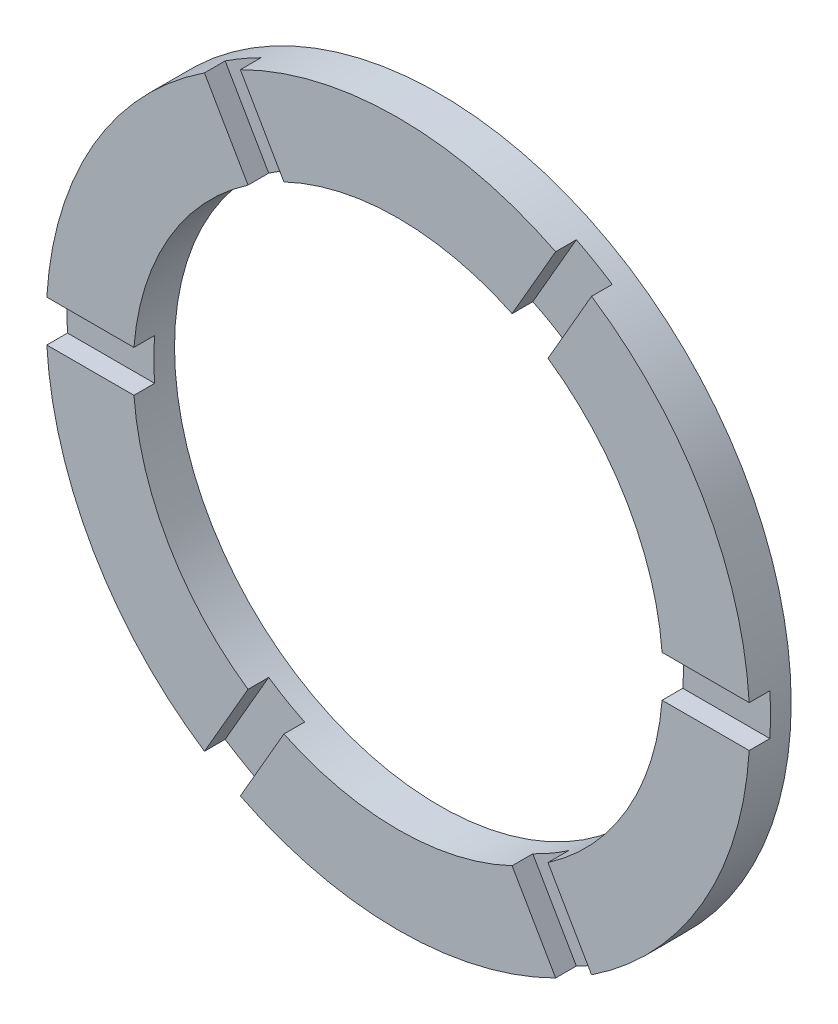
ISO-10303-21;
HEADER;
FILE_DESCRIPTION(('STEP AP214'),'2;1');
FILE_NAME('part.step','',(''),(''),'','','');
FILE_SCHEMA(('AUTOMOTIVE_DESIGN { 1 0 10303 214 1 1 1 1 }'));
ENDSEC;
DATA;
#1=APPLICATION_CONTEXT('core data for automotive mechanical design processes');
#2=APPLICATION_PROTOCOL_DEFINITION('international standard','automotive_design',2000,#1);
#3=PRODUCT_CONTEXT('',#1,'mechanical');
#4=PRODUCT('Part','Part','',(#3));
#5=PRODUCT_RELATED_PRODUCT_CATEGORY('part','',(#4));
#6=PRODUCT_DEFINITION_FORMATION('','',#4);
#7=PRODUCT_DEFINITION_CONTEXT('part definition',#1,'design');
#8=PRODUCT_DEFINITION('design','',#6,#7);
#9=PRODUCT_DEFINITION_SHAPE('','',#8);
#10=(LENGTH_UNIT() NAMED_UNIT(*) SI_UNIT(.MILLI.,.METRE.));
#11=(NAMED_UNIT(*) PLANE_ANGLE_UNIT() SI_UNIT($,.RADIAN.));
#12=(NAMED_UNIT(*) SI_UNIT($,.STERADIAN.) SOLID_ANGLE_UNIT());
#13=UNCERTAINTY_MEASURE_WITH_UNIT(LENGTH_MEASURE(1.E-05),#10,'distance_accuracy_value','');
#14=(GEOMETRIC_REPRESENTATION_CONTEXT(3) GLOBAL_UNCERTAINTY_ASSIGNED_CONTEXT((#13)) GLOBAL_UNIT_ASSIGNED_CONTEXT((#10,
#11,#12)) REPRESENTATION_CONTEXT('',''));
#15=CARTESIAN_POINT('',(0.,0.,0.));
#16=DIRECTION('',(0.,0.,1.));
#17=DIRECTION('',(1.,0.,0.));
#18=AXIS2_PLACEMENT_3D('',#15,#16,#17);
#19=CARTESIAN_POINT('',(0.,0.,0.5));
#20=DIRECTION('',(0.,0.,1.));
#21=DIRECTION('',(1.,0.,0.));
#22=AXIS2_PLACEMENT_3D('',#19,#20,#21);
#23=PLANE('',#22);
#24=DIRECTION('',(0.49999999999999,-0.866025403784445,0.));
#25=VECTOR('',#24,1.);
#26=CARTESIAN_POINT('',(-2.33812918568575,3.5490353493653,0.5));
#27=LINE('',#26,#25);
#28=CARTESIAN_POINT('',(-2.33812918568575,3.5490353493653,0.5));
#29=VERTEX_POINT('',#28);
#30=CARTESIAN_POINT('',(-1.81191503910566,2.63760571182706,0.5));
#31=VERTEX_POINT('',#30);
#32=EDGE_CURVE('E519',#29,#31,#27,.T.);
#33=ORIENTED_EDGE('',*,*,#32,.F.);
#34=CARTESIAN_POINT('',(0.,0.,0.5));
#35=DIRECTION('',(0.,0.,1.));
#36=DIRECTION('',(1.,0.,0.));
#37=AXIS2_PLACEMENT_3D('',#34,#35,#36);
#38=CIRCLE('',#37,4.25);
#39=CARTESIAN_POINT('',(-4.2426193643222,0.250361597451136,0.5));
#40=VERTEX_POINT('',#39);
#41=EDGE_CURVE('E535',#29,#40,#38,.T.);
#42=ORIENTED_EDGE('',*,*,#41,.T.);
#43=DIRECTION('',(-1.,0.,0.));
#44=VECTOR('',#43,1.);
#45=CARTESIAN_POINT('',(-3.07911993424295,0.250361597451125,0.5));
#46=LINE('',#45,#44);
#47=CARTESIAN_POINT('',(-3.190191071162,0.250361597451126,0.5));
#48=VERTEX_POINT('',#47);
#49=EDGE_CURVE('E635',#48,#40,#46,.T.);
#50=ORIENTED_EDGE('',*,*,#49,.F.);
#51=CARTESIAN_POINT('',(0.,0.,0.5));
#52=DIRECTION('',(0.,0.,1.));
#53=DIRECTION('',(1.,0.,0.));
#54=AXIS2_PLACEMENT_3D('',#51,#52,#53);
#55=CIRCLE('',#54,3.2);
#56=EDGE_CURVE('E554',#31,#48,#55,.T.);
#57=ORIENTED_EDGE('',*,*,#56,.F.);
#58=EDGE_LOOP('',(#33,#42,#50,#57));
#59=FACE_BOUND('',#58,.T.);
#60=ADVANCED_FACE('F348',(#59),#23,.T.);
#61=DIRECTION('',(1.,0.,0.));
#62=VECTOR('',#61,1.);
#63=CARTESIAN_POINT('',(-4.2426193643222,-0.250361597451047,0.5));
#64=LINE('',#63,#62);
#65=CARTESIAN_POINT('',(-4.24261936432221,-0.250361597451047,0.5));
#66=VERTEX_POINT('',#65);
#67=CARTESIAN_POINT('',(-3.190191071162,-0.250361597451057,0.5));
#68=VERTEX_POINT('',#67);
#69=EDGE_CURVE('E633',#66,#68,#64,.T.);
#70=ORIENTED_EDGE('',*,*,#69,.F.);
#71=CARTESIAN_POINT('',(-2.33812918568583,-3.54903534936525,0.5));
#72=VERTEX_POINT('',#71);
#73=EDGE_CURVE('E541',#66,#72,#38,.T.);
#74=ORIENTED_EDGE('',*,*,#73,.T.);
#75=DIRECTION('',(-0.500000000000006,-0.866025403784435,0.));
#76=VECTOR('',#75,1.);
#77=CARTESIAN_POINT('',(-1.7563794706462,-2.54141528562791,0.5));
#78=LINE('',#77,#76);
#79=CARTESIAN_POINT('',(-1.81191503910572,-2.63760571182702,0.5));
#80=VERTEX_POINT('',#79);
#81=EDGE_CURVE('E620',#80,#72,#78,.T.);
#82=ORIENTED_EDGE('',*,*,#81,.F.);
#83=EDGE_CURVE('E657',#68,#80,#55,.T.);
#84=ORIENTED_EDGE('',*,*,#83,.F.);
#85=EDGE_LOOP('',(#70,#74,#82,#84));
#86=FACE_BOUND('',#85,.T.);
#87=ADVANCED_FACE('F697',(#86),#23,.T.);
#88=DIRECTION('',(0.500000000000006,0.866025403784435,0.));
#89=VECTOR('',#88,1.);
#90=CARTESIAN_POINT('',(-1.90449017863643,-3.79939694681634,0.5));
#91=LINE('',#90,#89);
#92=CARTESIAN_POINT('',(-1.90449017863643,-3.79939694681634,0.5));
#93=VERTEX_POINT('',#92);
#94=CARTESIAN_POINT('',(-1.37827603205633,-2.88796730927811,0.5));
#95=VERTEX_POINT('',#94);
#96=EDGE_CURVE('E618',#93,#95,#91,.T.);
#97=ORIENTED_EDGE('',*,*,#96,.F.);
#98=CARTESIAN_POINT('',(1.90449017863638,-3.79939694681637,0.5));
#99=VERTEX_POINT('',#98);
#100=EDGE_CURVE('E550',#93,#99,#38,.T.);
#101=ORIENTED_EDGE('',*,*,#100,.T.);
#102=DIRECTION('',(0.499999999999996,-0.866025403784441,0.));
#103=VECTOR('',#102,1.);
#104=CARTESIAN_POINT('',(1.32274046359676,-2.79177688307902,0.5));
#105=LINE('',#104,#103);
#106=CARTESIAN_POINT('',(1.37827603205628,-2.88796730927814,0.5));
#107=VERTEX_POINT('',#106);
#108=EDGE_CURVE('E604',#107,#99,#105,.T.);
#109=ORIENTED_EDGE('',*,*,#108,.F.);
#110=EDGE_CURVE('E658',#95,#107,#55,.T.);
#111=ORIENTED_EDGE('',*,*,#110,.F.);
#112=EDGE_LOOP('',(#97,#101,#109,#111));
#113=FACE_BOUND('',#112,.T.);
#114=ADVANCED_FACE('F693',(#113),#23,.T.);
#115=DIRECTION('',(-0.499999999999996,0.866025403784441,0.));
#116=VECTOR('',#115,1.);
#117=CARTESIAN_POINT('',(2.33812918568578,-3.54903534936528,0.5));
#118=LINE('',#117,#116);
#119=CARTESIAN_POINT('',(2.33812918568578,-3.54903534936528,0.5));
#120=VERTEX_POINT('',#119);
#121=CARTESIAN_POINT('',(1.81191503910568,-2.63760571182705,0.5));
#122=VERTEX_POINT('',#121);
#123=EDGE_CURVE('E602',#120,#122,#118,.T.);
#124=ORIENTED_EDGE('',*,*,#123,.F.);
#125=CARTESIAN_POINT('',(4.2426193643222,-0.250361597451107,0.5));
#126=VERTEX_POINT('',#125);
#127=EDGE_CURVE('E543',#120,#126,#38,.T.);
#128=ORIENTED_EDGE('',*,*,#127,.T.);
#129=DIRECTION('',(1.,0.,0.));
#130=VECTOR('',#129,1.);
#131=CARTESIAN_POINT('',(3.07911993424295,-0.250361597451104,0.5));
#132=LINE('',#131,#130);
#133=CARTESIAN_POINT('',(3.190191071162,-0.250361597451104,0.5));
#134=VERTEX_POINT('',#133);
#135=EDGE_CURVE('E588',#134,#126,#132,.T.);
#136=ORIENTED_EDGE('',*,*,#135,.F.);
#137=EDGE_CURVE('E663',#122,#134,#55,.T.);
#138=ORIENTED_EDGE('',*,*,#137,.F.);
#139=EDGE_LOOP('',(#124,#128,#136,#138));
#140=FACE_BOUND('',#139,.T.);
#141=ADVANCED_FACE('F687',(#140),#23,.T.);
#142=DIRECTION('',(-1.,0.,0.));
#143=VECTOR('',#142,1.);
#144=CARTESIAN_POINT('',(4.2426193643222,0.250361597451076,0.5));
#145=LINE('',#144,#143);
#146=CARTESIAN_POINT('',(4.2426193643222,0.250361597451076,0.5));
#147=VERTEX_POINT('',#146);
#148=CARTESIAN_POINT('',(3.190191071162,0.250361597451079,0.5));
#149=VERTEX_POINT('',#148);
#150=EDGE_CURVE('E586',#147,#149,#145,.T.);
#151=ORIENTED_EDGE('',*,*,#150,.F.);
#152=CARTESIAN_POINT('',(2.3381291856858,3.54903534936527,0.5));
#153=VERTEX_POINT('',#152);
#154=EDGE_CURVE('E537',#147,#153,#38,.T.);
#155=ORIENTED_EDGE('',*,*,#154,.T.);
#156=DIRECTION('',(0.5,0.866025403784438,0.));
#157=VECTOR('',#156,1.);
#158=CARTESIAN_POINT('',(1.75637947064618,2.54141528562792,0.5));
#159=LINE('',#158,#157);
#160=CARTESIAN_POINT('',(1.8119150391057,2.63760571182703,0.5));
#161=VERTEX_POINT('',#160);
#162=EDGE_CURVE('E573',#161,#153,#159,.T.);
#163=ORIENTED_EDGE('',*,*,#162,.F.);
#164=EDGE_CURVE('E556',#149,#161,#55,.T.);
#165=ORIENTED_EDGE('',*,*,#164,.F.);
#166=EDGE_LOOP('',(#151,#155,#163,#165));
#167=FACE_BOUND('',#166,.T.);
#168=ADVANCED_FACE('F685',(#167),#23,.T.);
#169=DIRECTION('',(-0.49999999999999,0.866025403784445,0.));
#170=VECTOR('',#169,1.);
#171=CARTESIAN_POINT('',(-1.32274046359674,2.79177688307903,0.5));
#172=LINE('',#171,#170);
#173=CARTESIAN_POINT('',(-1.37827603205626,2.88796730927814,0.5));
#174=VERTEX_POINT('',#173);
#175=CARTESIAN_POINT('',(-1.90449017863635,3.79939694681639,0.5));
#176=VERTEX_POINT('',#175);
#177=EDGE_CURVE('E508',#174,#176,#172,.T.);
#178=ORIENTED_EDGE('',*,*,#177,.F.);
#179=CARTESIAN_POINT('',(1.37827603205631,2.88796730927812,0.5));
#180=VERTEX_POINT('',#179);
#181=EDGE_CURVE('E552',#180,#174,#55,.T.);
#182=ORIENTED_EDGE('',*,*,#181,.F.);
#183=DIRECTION('',(-0.5,-0.866025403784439,0.));
#184=VECTOR('',#183,1.);
#185=CARTESIAN_POINT('',(1.90449017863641,3.79939694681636,0.5));
#186=LINE('',#185,#184);
#187=CARTESIAN_POINT('',(1.90449017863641,3.79939694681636,0.5));
#188=VERTEX_POINT('',#187);
#189=EDGE_CURVE('E533',#188,#180,#186,.T.);
#190=ORIENTED_EDGE('',*,*,#189,.F.);
#191=EDGE_CURVE('E526',#188,#176,#38,.T.);
#192=ORIENTED_EDGE('',*,*,#191,.T.);
#193=EDGE_LOOP('',(#178,#182,#190,#192));
#194=FACE_BOUND('',#193,.T.);
#195=ADVANCED_FACE('F532',(#194),#23,.T.);
#196=CARTESIAN_POINT('',(0.,0.,0.));
#197=DIRECTION('',(0.,0.,1.));
#198=DIRECTION('',(1.,0.,0.));
#199=AXIS2_PLACEMENT_3D('',#196,#197,#198);
#200=PLANE('',#199);
#201=CARTESIAN_POINT('',(0.,0.,0.));
#202=DIRECTION('',(0.,0.,1.));
#203=DIRECTION('',(1.,0.,0.));
#204=AXIS2_PLACEMENT_3D('',#201,#202,#203);
#205=CIRCLE('',#204,4.25);
#206=CARTESIAN_POINT('',(4.25,0.,0.));
#207=VERTEX_POINT('',#206);
#208=EDGE_CURVE('E544',#207,#207,#205,.T.);
#209=ORIENTED_EDGE('',*,*,#208,.F.);
#210=EDGE_LOOP('',(#209));
#211=FACE_BOUND('',#210,.T.);
#212=CARTESIAN_POINT('',(0.,0.,0.));
#213=DIRECTION('',(0.,0.,1.));
#214=DIRECTION('',(1.,0.,0.));
#215=AXIS2_PLACEMENT_3D('',#212,#213,#214);
#216=CIRCLE('',#215,3.2);
#217=CARTESIAN_POINT('',(3.2,0.,0.));
#218=VERTEX_POINT('',#217);
#219=EDGE_CURVE('E558',#218,#218,#216,.T.);
#220=ORIENTED_EDGE('',*,*,#219,.T.);
#221=EDGE_LOOP('',(#220));
#222=FACE_BOUND('',#221,.T.);
#223=ADVANCED_FACE('F692',(#211,#222),#200,.F.);
#224=CARTESIAN_POINT('',(0.,0.,0.5));
#225=DIRECTION('',(0.,0.,-1.));
#226=DIRECTION('',(-1.,0.,0.));
#227=AXIS2_PLACEMENT_3D('',#224,#225,#226);
#228=CYLINDRICAL_SURFACE('',#227,4.25);
#229=ORIENTED_EDGE('',*,*,#41,.F.);
#230=DIRECTION('',(0.,0.,1.));
#231=VECTOR('',#230,1.);
#232=CARTESIAN_POINT('',(-2.33812918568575,3.5490353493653,0.25));
#233=LINE('',#232,#231);
#234=CARTESIAN_POINT('',(-2.33812918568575,3.5490353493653,0.25));
#235=VERTEX_POINT('',#234);
#236=EDGE_CURVE('E529',#235,#29,#233,.T.);
#237=ORIENTED_EDGE('',*,*,#236,.F.);
#238=CARTESIAN_POINT('',(0.,0.,0.25));
#239=DIRECTION('',(0.,0.,1.));
#240=DIRECTION('',(0.50000000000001,0.866025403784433,0.));
#241=AXIS2_PLACEMENT_3D('',#238,#239,#240);
#242=CIRCLE('',#241,4.25);
#243=CARTESIAN_POINT('',(-1.90449017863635,3.79939694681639,0.25));
#244=VERTEX_POINT('',#243);
#245=EDGE_CURVE('E528',#244,#235,#242,.T.);
#246=ORIENTED_EDGE('',*,*,#245,.F.);
#247=DIRECTION('',(0.,0.,1.));
#248=VECTOR('',#247,1.);
#249=CARTESIAN_POINT('',(-1.90449017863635,3.79939694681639,0.25));
#250=LINE('',#249,#248);
#251=EDGE_CURVE('E512',#244,#176,#250,.T.);
#252=ORIENTED_EDGE('',*,*,#251,.T.);
#253=ORIENTED_EDGE('',*,*,#191,.F.);
#254=DIRECTION('',(0.,0.,1.));
#255=VECTOR('',#254,1.);
#256=CARTESIAN_POINT('',(1.90449017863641,3.79939694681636,0.25));
#257=LINE('',#256,#255);
#258=CARTESIAN_POINT('',(1.90449017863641,3.79939694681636,0.25));
#259=VERTEX_POINT('',#258);
#260=EDGE_CURVE('E561',#259,#188,#257,.T.);
#261=ORIENTED_EDGE('',*,*,#260,.F.);
#262=CARTESIAN_POINT('',(0.,0.,0.25));
#263=DIRECTION('',(0.,0.,1.));
#264=DIRECTION('',(1.,0.,0.));
#265=AXIS2_PLACEMENT_3D('',#262,#263,#264);
#266=CIRCLE('',#265,4.25);
#267=CARTESIAN_POINT('',(2.3381291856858,3.54903534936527,0.25));
#268=VERTEX_POINT('',#267);
#269=EDGE_CURVE('E568',#268,#259,#266,.T.);
#270=ORIENTED_EDGE('',*,*,#269,.F.);
#271=DIRECTION('',(0.,0.,1.));
#272=VECTOR('',#271,1.);
#273=CARTESIAN_POINT('',(2.3381291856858,3.54903534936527,0.25));
#274=LINE('',#273,#272);
#275=EDGE_CURVE('E562',#268,#153,#274,.T.);
#276=ORIENTED_EDGE('',*,*,#275,.T.);
#277=ORIENTED_EDGE('',*,*,#154,.F.);
#278=DIRECTION('',(0.,0.,1.));
#279=VECTOR('',#278,1.);
#280=CARTESIAN_POINT('',(4.2426193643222,0.250361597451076,0.25));
#281=LINE('',#280,#279);
#282=CARTESIAN_POINT('',(4.2426193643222,0.250361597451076,0.25));
#283=VERTEX_POINT('',#282);
#284=EDGE_CURVE('E575',#283,#147,#281,.T.);
#285=ORIENTED_EDGE('',*,*,#284,.F.);
#286=CARTESIAN_POINT('',(0.,0.,0.25));
#287=DIRECTION('',(0.,0.,1.));
#288=DIRECTION('',(0.499999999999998,-0.86602540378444,0.));
#289=AXIS2_PLACEMENT_3D('',#286,#287,#288);
#290=CIRCLE('',#289,4.25);
#291=CARTESIAN_POINT('',(4.2426193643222,-0.250361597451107,0.25));
#292=VERTEX_POINT('',#291);
#293=EDGE_CURVE('E582',#292,#283,#290,.T.);
#294=ORIENTED_EDGE('',*,*,#293,.F.);
#295=DIRECTION('',(0.,0.,1.));
#296=VECTOR('',#295,1.);
#297=CARTESIAN_POINT('',(4.2426193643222,-0.250361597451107,0.25));
#298=LINE('',#297,#296);
#299=EDGE_CURVE('E576',#292,#126,#298,.T.);
#300=ORIENTED_EDGE('',*,*,#299,.T.);
#301=ORIENTED_EDGE('',*,*,#127,.F.);
#302=DIRECTION('',(0.,0.,1.));
#303=VECTOR('',#302,1.);
#304=CARTESIAN_POINT('',(2.33812918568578,-3.54903534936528,0.25));
#305=LINE('',#304,#303);
#306=CARTESIAN_POINT('',(2.33812918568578,-3.54903534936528,0.25));
#307=VERTEX_POINT('',#306);
#308=EDGE_CURVE('E591',#307,#120,#305,.T.);
#309=ORIENTED_EDGE('',*,*,#308,.F.);
#310=CARTESIAN_POINT('',(0.,0.,0.25));
#311=DIRECTION('',(0.,0.,1.));
#312=DIRECTION('',(-0.500000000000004,-0.866025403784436,0.));
#313=AXIS2_PLACEMENT_3D('',#310,#311,#312);
#314=CIRCLE('',#313,4.25);
#315=CARTESIAN_POINT('',(1.90449017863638,-3.79939694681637,0.25));
#316=VERTEX_POINT('',#315);
#317=EDGE_CURVE('E598',#316,#307,#314,.T.);
#318=ORIENTED_EDGE('',*,*,#317,.F.);
#319=DIRECTION('',(0.,0.,1.));
#320=VECTOR('',#319,1.);
#321=CARTESIAN_POINT('',(1.90449017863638,-3.79939694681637,0.25));
#322=LINE('',#321,#320);
#323=EDGE_CURVE('E592',#316,#99,#322,.T.);
#324=ORIENTED_EDGE('',*,*,#323,.T.);
#325=ORIENTED_EDGE('',*,*,#100,.F.);
#326=DIRECTION('',(0.,0.,1.));
#327=VECTOR('',#326,1.);
#328=CARTESIAN_POINT('',(-1.90449017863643,-3.79939694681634,0.25));
#329=LINE('',#328,#327);
#330=CARTESIAN_POINT('',(-1.90449017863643,-3.79939694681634,0.25));
#331=VERTEX_POINT('',#330);
#332=EDGE_CURVE('E607',#331,#93,#329,.T.);
#333=ORIENTED_EDGE('',*,*,#332,.F.);
#334=CARTESIAN_POINT('',(0.,0.,0.25));
#335=DIRECTION('',(0.,0.,1.));
#336=DIRECTION('',(-1.,0.,0.));
#337=AXIS2_PLACEMENT_3D('',#334,#335,#336);
#338=CIRCLE('',#337,4.25);
#339=CARTESIAN_POINT('',(-2.33812918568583,-3.54903534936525,0.25));
#340=VERTEX_POINT('',#339);
#341=EDGE_CURVE('E614',#340,#331,#338,.T.);
#342=ORIENTED_EDGE('',*,*,#341,.F.);
#343=DIRECTION('',(0.,0.,1.));
#344=VECTOR('',#343,1.);
#345=CARTESIAN_POINT('',(-2.33812918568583,-3.54903534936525,0.25));
#346=LINE('',#345,#344);
#347=EDGE_CURVE('E608',#340,#72,#346,.T.);
#348=ORIENTED_EDGE('',*,*,#347,.T.);
#349=ORIENTED_EDGE('',*,*,#73,.F.);
#350=DIRECTION('',(0.,0.,1.));
#351=VECTOR('',#350,1.);
#352=CARTESIAN_POINT('',(-4.24261936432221,-0.250361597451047,0.25));
#353=LINE('',#352,#351);
#354=CARTESIAN_POINT('',(-4.24261936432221,-0.250361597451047,0.25));
#355=VERTEX_POINT('',#354);
#356=EDGE_CURVE('E623',#355,#66,#353,.T.);
#357=ORIENTED_EDGE('',*,*,#356,.F.);
#358=CARTESIAN_POINT('',(0.,0.,0.25));
#359=DIRECTION('',(0.,0.,1.));
#360=DIRECTION('',(-0.499999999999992,0.866025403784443,0.));
#361=AXIS2_PLACEMENT_3D('',#358,#359,#360);
#362=CIRCLE('',#361,4.25);
#363=CARTESIAN_POINT('',(-4.2426193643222,0.250361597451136,0.25));
#364=VERTEX_POINT('',#363);
#365=EDGE_CURVE('E629',#364,#355,#362,.T.);
#366=ORIENTED_EDGE('',*,*,#365,.F.);
#367=DIRECTION('',(0.,0.,1.));
#368=VECTOR('',#367,1.);
#369=CARTESIAN_POINT('',(-4.2426193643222,0.250361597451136,0.25));
#370=LINE('',#369,#368);
#371=EDGE_CURVE('E624',#364,#40,#370,.T.);
#372=ORIENTED_EDGE('',*,*,#371,.T.);
#373=EDGE_LOOP('',(#229,#237,#246,#252,#253,#261,#270,#276,#277,#285,#294,#300,#301,#309,#318,
#324,#325,#333,#342,#348,#349,#357,#366,#372));
#374=FACE_BOUND('',#373,.T.);
#375=ORIENTED_EDGE('',*,*,#208,.T.);
#376=EDGE_LOOP('',(#375));
#377=FACE_BOUND('',#376,.T.);
#378=ADVANCED_FACE('F350',(#374,#377),#228,.T.);
#379=CARTESIAN_POINT('',(0.,0.,0.5));
#380=DIRECTION('',(0.,0.,-1.));
#381=DIRECTION('',(-1.,0.,0.));
#382=AXIS2_PLACEMENT_3D('',#379,#380,#381);
#383=CYLINDRICAL_SURFACE('',#382,3.2);
#384=DIRECTION('',(0.,0.,-1.));
#385=VECTOR('',#384,1.);
#386=CARTESIAN_POINT('',(-1.81191503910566,2.63760571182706,0.5));
#387=LINE('',#386,#385);
#388=CARTESIAN_POINT('',(-1.81191503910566,2.63760571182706,0.25));
#389=VERTEX_POINT('',#388);
#390=EDGE_CURVE('E11',#31,#389,#387,.T.);
#391=ORIENTED_EDGE('',*,*,#390,.F.);
#392=ORIENTED_EDGE('',*,*,#56,.T.);
#393=DIRECTION('',(0.,0.,-1.));
#394=VECTOR('',#393,1.);
#395=CARTESIAN_POINT('',(-3.190191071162,0.250361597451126,0.5));
#396=LINE('',#395,#394);
#397=CARTESIAN_POINT('',(-3.190191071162,0.250361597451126,0.25));
#398=VERTEX_POINT('',#397);
#399=EDGE_CURVE('E755',#398,#48,#396,.F.);
#400=ORIENTED_EDGE('',*,*,#399,.F.);
#401=CARTESIAN_POINT('',(0.,0.,0.25));
#402=DIRECTION('',(0.,0.,1.));
#403=DIRECTION('',(1.,0.,0.));
#404=AXIS2_PLACEMENT_3D('',#401,#402,#403);
#405=CIRCLE('',#404,3.2);
#406=CARTESIAN_POINT('',(-3.190191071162,-0.250361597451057,0.25));
#407=VERTEX_POINT('',#406);
#408=EDGE_CURVE('E752',#398,#407,#405,.T.);
#409=ORIENTED_EDGE('',*,*,#408,.T.);
#410=DIRECTION('',(0.,0.,-1.));
#411=VECTOR('',#410,1.);
#412=CARTESIAN_POINT('',(-3.190191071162,-0.250361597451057,0.5));
#413=LINE('',#412,#411);
#414=EDGE_CURVE('E757',#68,#407,#413,.T.);
#415=ORIENTED_EDGE('',*,*,#414,.F.);
#416=ORIENTED_EDGE('',*,*,#83,.T.);
#417=DIRECTION('',(0.,0.,-1.));
#418=VECTOR('',#417,1.);
#419=CARTESIAN_POINT('',(-1.81191503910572,-2.63760571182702,0.5));
#420=LINE('',#419,#418);
#421=CARTESIAN_POINT('',(-1.81191503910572,-2.63760571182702,0.25));
#422=VERTEX_POINT('',#421);
#423=EDGE_CURVE('E747',#422,#80,#420,.F.);
#424=ORIENTED_EDGE('',*,*,#423,.F.);
#425=CARTESIAN_POINT('',(0.,0.,0.25));
#426=DIRECTION('',(0.,0.,1.));
#427=DIRECTION('',(1.,0.,0.));
#428=AXIS2_PLACEMENT_3D('',#425,#426,#427);
#429=CIRCLE('',#428,3.2);
#430=CARTESIAN_POINT('',(-1.37827603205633,-2.88796730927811,0.25));
#431=VERTEX_POINT('',#430);
#432=EDGE_CURVE('E736',#422,#431,#429,.T.);
#433=ORIENTED_EDGE('',*,*,#432,.T.);
#434=DIRECTION('',(0.,0.,-1.));
#435=VECTOR('',#434,1.);
#436=CARTESIAN_POINT('',(-1.37827603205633,-2.88796730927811,0.5));
#437=LINE('',#436,#435);
#438=EDGE_CURVE('E749',#95,#431,#437,.T.);
#439=ORIENTED_EDGE('',*,*,#438,.F.);
#440=ORIENTED_EDGE('',*,*,#110,.T.);
#441=DIRECTION('',(0.,0.,-1.));
#442=VECTOR('',#441,1.);
#443=CARTESIAN_POINT('',(1.37827603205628,-2.88796730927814,0.5));
#444=LINE('',#443,#442);
#445=CARTESIAN_POINT('',(1.37827603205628,-2.88796730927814,0.25));
#446=VERTEX_POINT('',#445);
#447=EDGE_CURVE('E724',#446,#107,#444,.F.);
#448=ORIENTED_EDGE('',*,*,#447,.F.);
#449=CARTESIAN_POINT('',(0.,0.,0.25));
#450=DIRECTION('',(0.,0.,1.));
#451=DIRECTION('',(1.,0.,0.));
#452=AXIS2_PLACEMENT_3D('',#449,#450,#451);
#453=CIRCLE('',#452,3.2);
#454=CARTESIAN_POINT('',(1.81191503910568,-2.63760571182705,0.25));
#455=VERTEX_POINT('',#454);
#456=EDGE_CURVE('E738',#446,#455,#453,.T.);
#457=ORIENTED_EDGE('',*,*,#456,.T.);
#458=DIRECTION('',(0.,0.,-1.));
#459=VECTOR('',#458,1.);
#460=CARTESIAN_POINT('',(1.81191503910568,-2.63760571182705,0.5));
#461=LINE('',#460,#459);
#462=EDGE_CURVE('E734',#122,#455,#461,.T.);
#463=ORIENTED_EDGE('',*,*,#462,.F.);
#464=ORIENTED_EDGE('',*,*,#137,.T.);
#465=DIRECTION('',(0.,0.,-1.));
#466=VECTOR('',#465,1.);
#467=CARTESIAN_POINT('',(3.190191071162,-0.250361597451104,0.5));
#468=LINE('',#467,#466);
#469=CARTESIAN_POINT('',(3.190191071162,-0.250361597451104,0.25));
#470=VERTEX_POINT('',#469);
#471=EDGE_CURVE('E741',#470,#134,#468,.F.);
#472=ORIENTED_EDGE('',*,*,#471,.F.);
#473=CARTESIAN_POINT('',(0.,0.,0.25));
#474=DIRECTION('',(0.,0.,1.));
#475=DIRECTION('',(1.,0.,0.));
#476=AXIS2_PLACEMENT_3D('',#473,#474,#475);
#477=CIRCLE('',#476,3.2);
#478=CARTESIAN_POINT('',(3.190191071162,0.250361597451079,0.25));
#479=VERTEX_POINT('',#478);
#480=EDGE_CURVE('E900',#470,#479,#477,.T.);
#481=ORIENTED_EDGE('',*,*,#480,.T.);
#482=DIRECTION('',(0.,0.,-1.));
#483=VECTOR('',#482,1.);
#484=CARTESIAN_POINT('',(3.190191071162,0.250361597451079,0.5));
#485=LINE('',#484,#483);
#486=EDGE_CURVE('E678',#149,#479,#485,.T.);
#487=ORIENTED_EDGE('',*,*,#486,.F.);
#488=ORIENTED_EDGE('',*,*,#164,.T.);
#489=DIRECTION('',(0.,0.,-1.));
#490=VECTOR('',#489,1.);
#491=CARTESIAN_POINT('',(1.8119150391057,2.63760571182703,0.5));
#492=LINE('',#491,#490);
#493=CARTESIAN_POINT('',(1.8119150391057,2.63760571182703,0.25));
#494=VERTEX_POINT('',#493);
#495=EDGE_CURVE('E539',#494,#161,#492,.F.);
#496=ORIENTED_EDGE('',*,*,#495,.F.);
#497=CARTESIAN_POINT('',(0.,0.,0.25));
#498=DIRECTION('',(0.,0.,1.));
#499=DIRECTION('',(1.,0.,0.));
#500=AXIS2_PLACEMENT_3D('',#497,#498,#499);
#501=CIRCLE('',#500,3.2);
#502=CARTESIAN_POINT('',(1.37827603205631,2.88796730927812,0.25));
#503=VERTEX_POINT('',#502);
#504=EDGE_CURVE('E534',#494,#503,#501,.T.);
#505=ORIENTED_EDGE('',*,*,#504,.T.);
#506=DIRECTION('',(0.,0.,-1.));
#507=VECTOR('',#506,1.);
#508=CARTESIAN_POINT('',(1.37827603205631,2.88796730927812,0.5));
#509=LINE('',#508,#507);
#510=EDGE_CURVE('E683',#180,#503,#509,.T.);
#511=ORIENTED_EDGE('',*,*,#510,.F.);
#512=ORIENTED_EDGE('',*,*,#181,.T.);
#513=DIRECTION('',(0.,0.,-1.));
#514=VECTOR('',#513,1.);
#515=CARTESIAN_POINT('',(-1.37827603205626,2.88796730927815,0.5));
#516=LINE('',#515,#514);
#517=CARTESIAN_POINT('',(-1.37827603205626,2.88796730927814,0.25));
#518=VERTEX_POINT('',#517);
#519=EDGE_CURVE('E356',#518,#174,#516,.F.);
#520=ORIENTED_EDGE('',*,*,#519,.F.);
#521=CARTESIAN_POINT('',(0.,0.,0.25));
#522=DIRECTION('',(0.,0.,1.));
#523=DIRECTION('',(1.,0.,0.));
#524=AXIS2_PLACEMENT_3D('',#521,#522,#523);
#525=CIRCLE('',#524,3.2);
#526=EDGE_CURVE('E655',#518,#389,#525,.T.);
#527=ORIENTED_EDGE('',*,*,#526,.T.);
#528=EDGE_LOOP('',(#391,#392,#400,#409,#415,#416,#424,#433,#439,#440,#448,#457,#463,#464,#472,
#481,#487,#488,#496,#505,#511,#512,#520,#527));
#529=FACE_BOUND('',#528,.T.);
#530=ORIENTED_EDGE('',*,*,#219,.F.);
#531=EDGE_LOOP('',(#530));
#532=FACE_BOUND('',#531,.T.);
#533=ADVANCED_FACE('F651',(#529,#532),#383,.F.);
#534=CARTESIAN_POINT('',(1.90449017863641,3.79939694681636,0.25));
#535=DIRECTION('',(-0.866025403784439,0.5,0.));
#536=DIRECTION('',(-0.5,-0.866025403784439,0.));
#537=AXIS2_PLACEMENT_3D('',#534,#535,#536);
#538=PLANE('',#537);
#539=ORIENTED_EDGE('',*,*,#510,.T.);
#540=DIRECTION('',(-0.5,-0.866025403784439,0.));
#541=VECTOR('',#540,1.);
#542=CARTESIAN_POINT('',(1.90449017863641,3.79939694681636,0.25));
#543=LINE('',#542,#541);
#544=EDGE_CURVE('E565',#259,#503,#543,.T.);
#545=ORIENTED_EDGE('',*,*,#544,.F.);
#546=ORIENTED_EDGE('',*,*,#260,.T.);
#547=ORIENTED_EDGE('',*,*,#189,.T.);
#548=EDGE_LOOP('',(#539,#545,#546,#547));
#549=FACE_BOUND('',#548,.T.);
#550=ADVANCED_FACE('F807',(#549),#538,.F.);
#551=CARTESIAN_POINT('',(1.75637947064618,2.54141528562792,0.25));
#552=DIRECTION('',(0.866025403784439,-0.5,0.));
#553=DIRECTION('',(0.5,0.866025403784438,0.));
#554=AXIS2_PLACEMENT_3D('',#551,#552,#553);
#555=PLANE('',#554);
#556=ORIENTED_EDGE('',*,*,#495,.T.);
#557=ORIENTED_EDGE('',*,*,#162,.T.);
#558=ORIENTED_EDGE('',*,*,#275,.F.);
#559=DIRECTION('',(0.5,0.866025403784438,0.));
#560=VECTOR('',#559,1.);
#561=CARTESIAN_POINT('',(1.75637947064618,2.54141528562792,0.25));
#562=LINE('',#561,#560);
#563=EDGE_CURVE('E570',#494,#268,#562,.T.);
#564=ORIENTED_EDGE('',*,*,#563,.F.);
#565=EDGE_LOOP('',(#556,#557,#558,#564));
#566=FACE_BOUND('',#565,.T.);
#567=ADVANCED_FACE('F681',(#566),#555,.F.);
#568=CARTESIAN_POINT('',(0.,0.,0.25));
#569=DIRECTION('',(0.,0.,1.));
#570=DIRECTION('',(1.,0.,0.));
#571=AXIS2_PLACEMENT_3D('',#568,#569,#570);
#572=PLANE('',#571);
#573=ORIENTED_EDGE('',*,*,#563,.T.);
#574=ORIENTED_EDGE('',*,*,#269,.T.);
#575=ORIENTED_EDGE('',*,*,#544,.T.);
#576=ORIENTED_EDGE('',*,*,#504,.F.);
#577=EDGE_LOOP('',(#573,#574,#575,#576));
#578=FACE_BOUND('',#577,.T.);
#579=ADVANCED_FACE('F800',(#578),#572,.T.);
#580=CARTESIAN_POINT('',(4.2426193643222,0.250361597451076,0.25));
#581=DIRECTION('',(0.,1.,0.));
#582=DIRECTION('',(-1.,0.,0.));
#583=AXIS2_PLACEMENT_3D('',#580,#581,#582);
#584=PLANE('',#583);
#585=ORIENTED_EDGE('',*,*,#486,.T.);
#586=DIRECTION('',(-1.,0.,0.));
#587=VECTOR('',#586,1.);
#588=CARTESIAN_POINT('',(4.2426193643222,0.250361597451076,0.25));
#589=LINE('',#588,#587);
#590=EDGE_CURVE('E579',#283,#479,#589,.T.);
#591=ORIENTED_EDGE('',*,*,#590,.F.);
#592=ORIENTED_EDGE('',*,*,#284,.T.);
#593=ORIENTED_EDGE('',*,*,#150,.T.);
#594=EDGE_LOOP('',(#585,#591,#592,#593));
#595=FACE_BOUND('',#594,.T.);
#596=ADVANCED_FACE('F797',(#595),#584,.F.);
#597=CARTESIAN_POINT('',(3.07911993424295,-0.250361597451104,0.25));
#598=DIRECTION('',(0.,-1.,0.));
#599=DIRECTION('',(1.,0.,0.));
#600=AXIS2_PLACEMENT_3D('',#597,#598,#599);
#601=PLANE('',#600);
#602=ORIENTED_EDGE('',*,*,#471,.T.);
#603=ORIENTED_EDGE('',*,*,#135,.T.);
#604=ORIENTED_EDGE('',*,*,#299,.F.);
#605=DIRECTION('',(1.,0.,0.));
#606=VECTOR('',#605,1.);
#607=CARTESIAN_POINT('',(3.07911993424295,-0.250361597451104,0.25));
#608=LINE('',#607,#606);
#609=EDGE_CURVE('E584',#470,#292,#608,.T.);
#610=ORIENTED_EDGE('',*,*,#609,.F.);
#611=EDGE_LOOP('',(#602,#603,#604,#610));
#612=FACE_BOUND('',#611,.T.);
#613=ADVANCED_FACE('F795',(#612),#601,.F.);
#614=CARTESIAN_POINT('',(0.,0.,0.25));
#615=DIRECTION('',(0.,0.,1.));
#616=DIRECTION('',(0.499999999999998,-0.86602540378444,0.));
#617=AXIS2_PLACEMENT_3D('',#614,#615,#616);
#618=PLANE('',#617);
#619=ORIENTED_EDGE('',*,*,#609,.T.);
#620=ORIENTED_EDGE('',*,*,#293,.T.);
#621=ORIENTED_EDGE('',*,*,#590,.T.);
#622=ORIENTED_EDGE('',*,*,#480,.F.);
#623=EDGE_LOOP('',(#619,#620,#621,#622));
#624=FACE_BOUND('',#623,.T.);
#625=ADVANCED_FACE('F790',(#624),#618,.T.);
#626=CARTESIAN_POINT('',(2.33812918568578,-3.54903534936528,0.25));
#627=DIRECTION('',(0.866025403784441,0.499999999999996,0.));
#628=DIRECTION('',(-0.499999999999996,0.866025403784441,0.));
#629=AXIS2_PLACEMENT_3D('',#626,#627,#628);
#630=PLANE('',#629);
#631=ORIENTED_EDGE('',*,*,#462,.T.);
#632=DIRECTION('',(-0.499999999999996,0.866025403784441,0.));
#633=VECTOR('',#632,1.);
#634=CARTESIAN_POINT('',(2.33812918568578,-3.54903534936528,0.25));
#635=LINE('',#634,#633);
#636=EDGE_CURVE('E595',#307,#455,#635,.T.);
#637=ORIENTED_EDGE('',*,*,#636,.F.);
#638=ORIENTED_EDGE('',*,*,#308,.T.);
#639=ORIENTED_EDGE('',*,*,#123,.T.);
#640=EDGE_LOOP('',(#631,#637,#638,#639));
#641=FACE_BOUND('',#640,.T.);
#642=ADVANCED_FACE('F732',(#641),#630,.F.);
#643=CARTESIAN_POINT('',(1.32274046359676,-2.79177688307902,0.25));
#644=DIRECTION('',(-0.866025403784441,-0.499999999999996,0.));
#645=DIRECTION('',(0.499999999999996,-0.866025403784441,0.));
#646=AXIS2_PLACEMENT_3D('',#643,#644,#645);
#647=PLANE('',#646);
#648=ORIENTED_EDGE('',*,*,#447,.T.);
#649=ORIENTED_EDGE('',*,*,#108,.T.);
#650=ORIENTED_EDGE('',*,*,#323,.F.);
#651=DIRECTION('',(0.499999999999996,-0.866025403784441,0.));
#652=VECTOR('',#651,1.);
#653=CARTESIAN_POINT('',(1.32274046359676,-2.79177688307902,0.25));
#654=LINE('',#653,#652);
#655=EDGE_CURVE('E600',#446,#316,#654,.T.);
#656=ORIENTED_EDGE('',*,*,#655,.F.);
#657=EDGE_LOOP('',(#648,#649,#650,#656));
#658=FACE_BOUND('',#657,.T.);
#659=ADVANCED_FACE('F721',(#658),#647,.F.);
#660=CARTESIAN_POINT('',(0.,0.,0.25));
#661=DIRECTION('',(0.,0.,1.));
#662=DIRECTION('',(-0.500000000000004,-0.866025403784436,0.));
#663=AXIS2_PLACEMENT_3D('',#660,#661,#662);
#664=PLANE('',#663);
#665=ORIENTED_EDGE('',*,*,#655,.T.);
#666=ORIENTED_EDGE('',*,*,#317,.T.);
#667=ORIENTED_EDGE('',*,*,#636,.T.);
#668=ORIENTED_EDGE('',*,*,#456,.F.);
#669=EDGE_LOOP('',(#665,#666,#667,#668));
#670=FACE_BOUND('',#669,.T.);
#671=ADVANCED_FACE('F729',(#670),#664,.T.);
#672=CARTESIAN_POINT('',(-1.90449017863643,-3.79939694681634,0.25));
#673=DIRECTION('',(0.866025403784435,-0.500000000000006,0.));
#674=DIRECTION('',(0.500000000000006,0.866025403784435,0.));
#675=AXIS2_PLACEMENT_3D('',#672,#673,#674);
#676=PLANE('',#675);
#677=ORIENTED_EDGE('',*,*,#438,.T.);
#678=DIRECTION('',(0.500000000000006,0.866025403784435,0.));
#679=VECTOR('',#678,1.);
#680=CARTESIAN_POINT('',(-1.90449017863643,-3.79939694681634,0.25));
#681=LINE('',#680,#679);
#682=EDGE_CURVE('E611',#331,#431,#681,.T.);
#683=ORIENTED_EDGE('',*,*,#682,.F.);
#684=ORIENTED_EDGE('',*,*,#332,.T.);
#685=ORIENTED_EDGE('',*,*,#96,.T.);
#686=EDGE_LOOP('',(#677,#683,#684,#685));
#687=FACE_BOUND('',#686,.T.);
#688=ADVANCED_FACE('F779',(#687),#676,.F.);
#689=CARTESIAN_POINT('',(-1.7563794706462,-2.54141528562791,0.25));
#690=DIRECTION('',(-0.866025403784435,0.500000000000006,0.));
#691=DIRECTION('',(-0.500000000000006,-0.866025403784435,0.));
#692=AXIS2_PLACEMENT_3D('',#689,#690,#691);
#693=PLANE('',#692);
#694=ORIENTED_EDGE('',*,*,#423,.T.);
#695=ORIENTED_EDGE('',*,*,#81,.T.);
#696=ORIENTED_EDGE('',*,*,#347,.F.);
#697=DIRECTION('',(-0.500000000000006,-0.866025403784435,0.));
#698=VECTOR('',#697,1.);
#699=CARTESIAN_POINT('',(-1.7563794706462,-2.54141528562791,0.25));
#700=LINE('',#699,#698);
#701=EDGE_CURVE('E616',#422,#340,#700,.T.);
#702=ORIENTED_EDGE('',*,*,#701,.F.);
#703=EDGE_LOOP('',(#694,#695,#696,#702));
#704=FACE_BOUND('',#703,.T.);
#705=ADVANCED_FACE('F777',(#704),#693,.F.);
#706=CARTESIAN_POINT('',(0.,0.,0.25));
#707=DIRECTION('',(0.,0.,1.));
#708=DIRECTION('',(-1.,0.,0.));
#709=AXIS2_PLACEMENT_3D('',#706,#707,#708);
#710=PLANE('',#709);
#711=ORIENTED_EDGE('',*,*,#701,.T.);
#712=ORIENTED_EDGE('',*,*,#341,.T.);
#713=ORIENTED_EDGE('',*,*,#682,.T.);
#714=ORIENTED_EDGE('',*,*,#432,.F.);
#715=EDGE_LOOP('',(#711,#712,#713,#714));
#716=FACE_BOUND('',#715,.T.);
#717=ADVANCED_FACE('F772',(#716),#710,.T.);
#718=CARTESIAN_POINT('',(-4.2426193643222,-0.250361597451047,0.25));
#719=DIRECTION('',(0.,-1.,0.));
#720=DIRECTION('',(1.,0.,0.));
#721=AXIS2_PLACEMENT_3D('',#718,#719,#720);
#722=PLANE('',#721);
#723=ORIENTED_EDGE('',*,*,#414,.T.);
#724=DIRECTION('',(1.,0.,0.));
#725=VECTOR('',#724,1.);
#726=CARTESIAN_POINT('',(-4.2426193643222,-0.250361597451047,0.25));
#727=LINE('',#726,#725);
#728=EDGE_CURVE('E370',#355,#407,#727,.T.);
#729=ORIENTED_EDGE('',*,*,#728,.F.);
#730=ORIENTED_EDGE('',*,*,#356,.T.);
#731=ORIENTED_EDGE('',*,*,#69,.T.);
#732=EDGE_LOOP('',(#723,#729,#730,#731));
#733=FACE_BOUND('',#732,.T.);
#734=ADVANCED_FACE('F759',(#733),#722,.F.);
#735=CARTESIAN_POINT('',(-3.07911993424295,0.250361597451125,0.25));
#736=DIRECTION('',(0.,1.,0.));
#737=DIRECTION('',(-1.,0.,0.));
#738=AXIS2_PLACEMENT_3D('',#735,#736,#737);
#739=PLANE('',#738);
#740=ORIENTED_EDGE('',*,*,#399,.T.);
#741=ORIENTED_EDGE('',*,*,#49,.T.);
#742=ORIENTED_EDGE('',*,*,#371,.F.);
#743=DIRECTION('',(-1.,0.,0.));
#744=VECTOR('',#743,1.);
#745=CARTESIAN_POINT('',(-3.07911993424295,0.250361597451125,0.25));
#746=LINE('',#745,#744);
#747=EDGE_CURVE('E631',#398,#364,#746,.T.);
#748=ORIENTED_EDGE('',*,*,#747,.F.);
#749=EDGE_LOOP('',(#740,#741,#742,#748));
#750=FACE_BOUND('',#749,.T.);
#751=ADVANCED_FACE('F764',(#750),#739,.F.);
#752=CARTESIAN_POINT('',(0.,0.,0.25));
#753=DIRECTION('',(0.,0.,1.));
#754=DIRECTION('',(-0.499999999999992,0.866025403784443,0.));
#755=AXIS2_PLACEMENT_3D('',#752,#753,#754);
#756=PLANE('',#755);
#757=ORIENTED_EDGE('',*,*,#747,.T.);
#758=ORIENTED_EDGE('',*,*,#365,.T.);
#759=ORIENTED_EDGE('',*,*,#728,.T.);
#760=ORIENTED_EDGE('',*,*,#408,.F.);
#761=EDGE_LOOP('',(#757,#758,#759,#760));
#762=FACE_BOUND('',#761,.T.);
#763=ADVANCED_FACE('F761',(#762),#756,.T.);
#764=CARTESIAN_POINT('',(-2.33812918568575,3.5490353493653,0.25));
#765=DIRECTION('',(-0.866025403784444,-0.49999999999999,0.));
#766=DIRECTION('',(0.49999999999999,-0.866025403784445,0.));
#767=AXIS2_PLACEMENT_3D('',#764,#765,#766);
#768=PLANE('',#767);
#769=ORIENTED_EDGE('',*,*,#390,.T.);
#770=DIRECTION('',(0.49999999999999,-0.866025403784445,0.));
#771=VECTOR('',#770,1.);
#772=CARTESIAN_POINT('',(-2.33812918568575,3.5490353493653,0.25));
#773=LINE('',#772,#771);
#774=EDGE_CURVE('E363',#235,#389,#773,.T.);
#775=ORIENTED_EDGE('',*,*,#774,.F.);
#776=ORIENTED_EDGE('',*,*,#236,.T.);
#777=ORIENTED_EDGE('',*,*,#32,.T.);
#778=EDGE_LOOP('',(#769,#775,#776,#777));
#779=FACE_BOUND('',#778,.T.);
#780=ADVANCED_FACE('F646',(#779),#768,.F.);
#781=CARTESIAN_POINT('',(-1.32274046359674,2.79177688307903,0.25));
#782=DIRECTION('',(0.866025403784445,0.49999999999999,0.));
#783=DIRECTION('',(-0.49999999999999,0.866025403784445,0.));
#784=AXIS2_PLACEMENT_3D('',#781,#782,#783);
#785=PLANE('',#784);
#786=ORIENTED_EDGE('',*,*,#519,.T.);
#787=ORIENTED_EDGE('',*,*,#177,.T.);
#788=ORIENTED_EDGE('',*,*,#251,.F.);
#789=DIRECTION('',(-0.49999999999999,0.866025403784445,0.));
#790=VECTOR('',#789,1.);
#791=CARTESIAN_POINT('',(-1.32274046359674,2.79177688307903,0.25));
#792=LINE('',#791,#790);
#793=EDGE_CURVE('E641',#518,#244,#792,.T.);
#794=ORIENTED_EDGE('',*,*,#793,.F.);
#795=EDGE_LOOP('',(#786,#787,#788,#794));
#796=FACE_BOUND('',#795,.T.);
#797=ADVANCED_FACE('F510',(#796),#785,.F.);
#798=CARTESIAN_POINT('',(0.,0.,0.25));
#799=DIRECTION('',(0.,0.,1.));
#800=DIRECTION('',(0.50000000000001,0.866025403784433,0.));
#801=AXIS2_PLACEMENT_3D('',#798,#799,#800);
#802=PLANE('',#801);
#803=ORIENTED_EDGE('',*,*,#793,.T.);
#804=ORIENTED_EDGE('',*,*,#245,.T.);
#805=ORIENTED_EDGE('',*,*,#774,.T.);
#806=ORIENTED_EDGE('',*,*,#526,.F.);
#807=EDGE_LOOP('',(#803,#804,#805,#806));
#808=FACE_BOUND('',#807,.T.);
#809=ADVANCED_FACE('F889',(#808),#802,.T.);
#810=CLOSED_SHELL('',(#60,#87,#114,#141,#168,#195,#223,#378,#533,#550,#567,#579,#596,#613,#625,
#642,#659,#671,#688,#705,#717,#734,#751,#763,#780,#797,#809));
#811=MANIFOLD_SOLID_BREP('B2',#810);
#812=ADVANCED_BREP_SHAPE_REPRESENTATION('',(#18,#811),#14);
#813=SHAPE_DEFINITION_REPRESENTATION(#9,#812);
ENDSEC;
END-ISO-10303-21;
